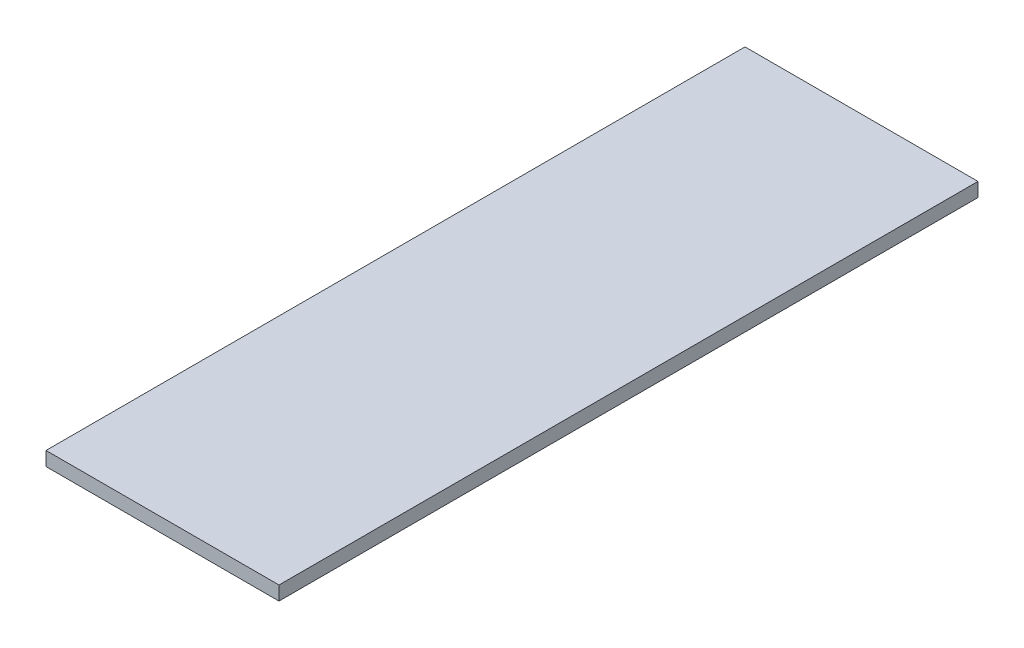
from build123d import *

# Parameters (mm, degrees)
ESQUISSE1_W        = 50
ESQUISSE1_H        = 150
BOSS_EXTRU_1_DEPTH = 3


with BuildPart() as part:
    # Esquisse1 → Boss.-Extru.1 (new body)
    with BuildSketch(Plane(origin=(0, 0, 0), x_dir=(1, 0, 0), z_dir=(0, 1, 0))):
        Rectangle(ESQUISSE1_W, ESQUISSE1_H)
    extrude(amount=BOSS_EXTRU_1_DEPTH)


solid = part.part
